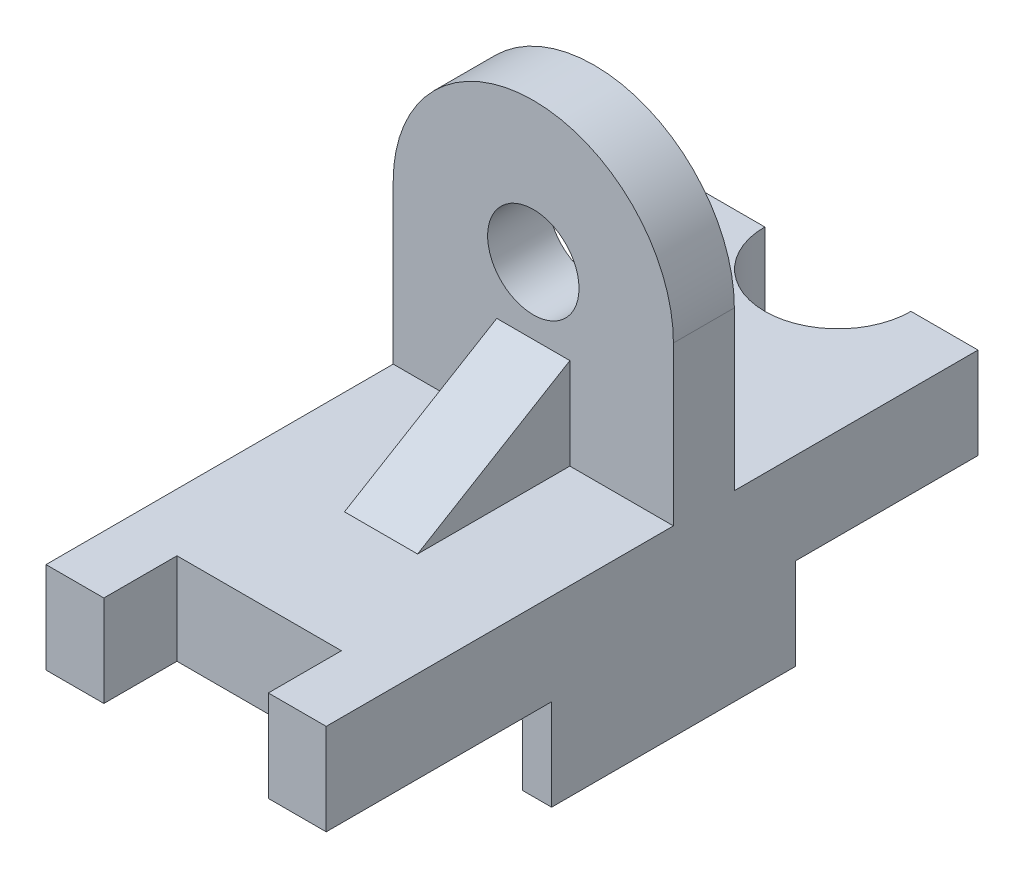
ISO-10303-21;
HEADER;
FILE_DESCRIPTION(('STEP AP214'),'2;1');
FILE_NAME('part.step','',(''),(''),'','','');
FILE_SCHEMA(('AUTOMOTIVE_DESIGN { 1 0 10303 214 1 1 1 1 }'));
ENDSEC;
DATA;
#1=APPLICATION_CONTEXT('core data for automotive mechanical design processes');
#2=APPLICATION_PROTOCOL_DEFINITION('international standard','automotive_design',2000,#1);
#3=PRODUCT_CONTEXT('',#1,'mechanical');
#4=PRODUCT('Part','Part','',(#3));
#5=PRODUCT_RELATED_PRODUCT_CATEGORY('part','',(#4));
#6=PRODUCT_DEFINITION_FORMATION('','',#4);
#7=PRODUCT_DEFINITION_CONTEXT('part definition',#1,'design');
#8=PRODUCT_DEFINITION('design','',#6,#7);
#9=PRODUCT_DEFINITION_SHAPE('','',#8);
#10=(LENGTH_UNIT() NAMED_UNIT(*) SI_UNIT(.MILLI.,.METRE.));
#11=(NAMED_UNIT(*) PLANE_ANGLE_UNIT() SI_UNIT($,.RADIAN.));
#12=(NAMED_UNIT(*) SI_UNIT($,.STERADIAN.) SOLID_ANGLE_UNIT());
#13=UNCERTAINTY_MEASURE_WITH_UNIT(LENGTH_MEASURE(1.E-05),#10,'distance_accuracy_value','');
#14=(GEOMETRIC_REPRESENTATION_CONTEXT(3) GLOBAL_UNCERTAINTY_ASSIGNED_CONTEXT((#13)) GLOBAL_UNIT_ASSIGNED_CONTEXT((#10,
#11,#12)) REPRESENTATION_CONTEXT('',''));
#15=CARTESIAN_POINT('',(0.,0.,0.));
#16=DIRECTION('',(0.,0.,1.));
#17=DIRECTION('',(1.,0.,0.));
#18=AXIS2_PLACEMENT_3D('',#15,#16,#17);
#19=CARTESIAN_POINT('',(-23.,-30.,-25.));
#20=DIRECTION('',(0.,0.,1.));
#21=DIRECTION('',(1.,0.,0.));
#22=AXIS2_PLACEMENT_3D('',#19,#20,#21);
#23=PLANE('',#22);
#24=DIRECTION('',(-1.,0.,0.));
#25=VECTOR('',#24,1.);
#26=CARTESIAN_POINT('',(0.,-20.,-25.));
#27=LINE('',#26,#25);
#28=CARTESIAN_POINT('',(18.2163610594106,-20.,-25.));
#29=VERTEX_POINT('',#28);
#30=CARTESIAN_POINT('',(-18.7836389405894,-20.,-25.));
#31=VERTEX_POINT('',#30);
#32=EDGE_CURVE('E262',#29,#31,#27,.T.);
#33=ORIENTED_EDGE('',*,*,#32,.F.);
#34=DIRECTION('',(0.,-1.,0.));
#35=VECTOR('',#34,1.);
#36=CARTESIAN_POINT('',(18.2163610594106,-20.,-25.));
#37=LINE('',#36,#35);
#38=CARTESIAN_POINT('',(18.2163610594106,-30.,-25.));
#39=VERTEX_POINT('',#38);
#40=EDGE_CURVE('E249',#29,#39,#37,.T.);
#41=ORIENTED_EDGE('',*,*,#40,.T.);
#42=DIRECTION('',(1.,0.,0.));
#43=VECTOR('',#42,1.);
#44=CARTESIAN_POINT('',(-23.,-30.,-25.));
#45=LINE('',#44,#43);
#46=CARTESIAN_POINT('',(23.,-30.,-25.));
#47=VERTEX_POINT('',#46);
#48=EDGE_CURVE('E309',#39,#47,#45,.T.);
#49=ORIENTED_EDGE('',*,*,#48,.T.);
#50=DIRECTION('',(0.,1.,0.));
#51=VECTOR('',#50,1.);
#52=CARTESIAN_POINT('',(23.,-30.,-25.));
#53=LINE('',#52,#51);
#54=CARTESIAN_POINT('',(23.,-15.,-25.));
#55=VERTEX_POINT('',#54);
#56=EDGE_CURVE('E105',#47,#55,#53,.T.);
#57=ORIENTED_EDGE('',*,*,#56,.T.);
#58=DIRECTION('',(1.,0.,0.));
#59=VECTOR('',#58,1.);
#60=CARTESIAN_POINT('',(-23.,-15.,-25.));
#61=LINE('',#60,#59);
#62=CARTESIAN_POINT('',(-23.,-15.,-25.));
#63=VERTEX_POINT('',#62);
#64=EDGE_CURVE('E305',#63,#55,#61,.T.);
#65=ORIENTED_EDGE('',*,*,#64,.F.);
#66=DIRECTION('',(0.,1.,0.));
#67=VECTOR('',#66,1.);
#68=CARTESIAN_POINT('',(-23.,-30.,-25.));
#69=LINE('',#68,#67);
#70=CARTESIAN_POINT('',(-23.,-30.,-25.));
#71=VERTEX_POINT('',#70);
#72=EDGE_CURVE('E317',#71,#63,#69,.T.);
#73=ORIENTED_EDGE('',*,*,#72,.F.);
#74=CARTESIAN_POINT('',(-18.7836389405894,-30.,-25.));
#75=VERTEX_POINT('',#74);
#76=EDGE_CURVE('E310',#71,#75,#45,.T.);
#77=ORIENTED_EDGE('',*,*,#76,.T.);
#78=DIRECTION('',(0.,-1.,0.));
#79=VECTOR('',#78,1.);
#80=CARTESIAN_POINT('',(-18.7836389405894,-20.,-25.));
#81=LINE('',#80,#79);
#82=EDGE_CURVE('E258',#31,#75,#81,.T.);
#83=ORIENTED_EDGE('',*,*,#82,.F.);
#84=EDGE_LOOP('',(#33,#41,#49,#57,#65,#73,#77,#83));
#85=FACE_BOUND('',#84,.T.);
#86=ADVANCED_FACE('F81',(#85),#23,.T.);
#87=CARTESIAN_POINT('',(0.,-30.,0.));
#88=DIRECTION('',(0.,1.,0.));
#89=DIRECTION('',(-1.,0.,0.));
#90=AXIS2_PLACEMENT_3D('',#87,#88,#89);
#91=PLANE('',#90);
#92=DIRECTION('',(0.,0.,-1.));
#93=VECTOR('',#92,1.);
#94=CARTESIAN_POINT('',(18.2163610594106,-30.,0.));
#95=LINE('',#94,#93);
#96=CARTESIAN_POINT('',(18.2163610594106,-30.,-65.));
#97=VERTEX_POINT('',#96);
#98=EDGE_CURVE('E254',#39,#97,#95,.T.);
#99=ORIENTED_EDGE('',*,*,#98,.T.);
#100=DIRECTION('',(-1.,0.,0.));
#101=VECTOR('',#100,1.);
#102=CARTESIAN_POINT('',(23.,-30.,-65.));
#103=LINE('',#102,#101);
#104=CARTESIAN_POINT('',(23.,-30.,-65.));
#105=VERTEX_POINT('',#104);
#106=EDGE_CURVE('E291',#105,#97,#103,.T.);
#107=ORIENTED_EDGE('',*,*,#106,.F.);
#108=DIRECTION('',(0.,0.,-1.));
#109=VECTOR('',#108,1.);
#110=CARTESIAN_POINT('',(23.,-30.,-25.));
#111=LINE('',#110,#109);
#112=EDGE_CURVE('E306',#47,#105,#111,.T.);
#113=ORIENTED_EDGE('',*,*,#112,.F.);
#114=ORIENTED_EDGE('',*,*,#48,.F.);
#115=EDGE_LOOP('',(#99,#107,#113,#114));
#116=FACE_BOUND('',#115,.T.);
#117=ADVANCED_FACE('F570',(#116),#91,.F.);
#118=CARTESIAN_POINT('',(23.,-30.,-65.));
#119=DIRECTION('',(0.,0.,-1.));
#120=DIRECTION('',(-1.,0.,0.));
#121=AXIS2_PLACEMENT_3D('',#118,#119,#120);
#122=PLANE('',#121);
#123=ORIENTED_EDGE('',*,*,#106,.T.);
#124=DIRECTION('',(0.,-1.,0.));
#125=VECTOR('',#124,1.);
#126=CARTESIAN_POINT('',(18.2163610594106,-20.,-65.));
#127=LINE('',#126,#125);
#128=CARTESIAN_POINT('',(18.2163610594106,-20.,-65.));
#129=VERTEX_POINT('',#128);
#130=EDGE_CURVE('E281',#129,#97,#127,.T.);
#131=ORIENTED_EDGE('',*,*,#130,.F.);
#132=DIRECTION('',(1.,0.,0.));
#133=VECTOR('',#132,1.);
#134=CARTESIAN_POINT('',(0.,-20.,-65.));
#135=LINE('',#134,#133);
#136=CARTESIAN_POINT('',(-18.7836389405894,-20.,-65.));
#137=VERTEX_POINT('',#136);
#138=EDGE_CURVE('E259',#137,#129,#135,.T.);
#139=ORIENTED_EDGE('',*,*,#138,.F.);
#140=DIRECTION('',(0.,-1.,0.));
#141=VECTOR('',#140,1.);
#142=CARTESIAN_POINT('',(-18.7836389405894,-20.,-65.));
#143=LINE('',#142,#141);
#144=CARTESIAN_POINT('',(-18.7836389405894,-30.,-65.));
#145=VERTEX_POINT('',#144);
#146=EDGE_CURVE('E285',#137,#145,#143,.T.);
#147=ORIENTED_EDGE('',*,*,#146,.T.);
#148=CARTESIAN_POINT('',(-23.,-30.,-65.));
#149=VERTEX_POINT('',#148);
#150=EDGE_CURVE('E296',#145,#149,#103,.T.);
#151=ORIENTED_EDGE('',*,*,#150,.T.);
#152=DIRECTION('',(0.,1.,0.));
#153=VECTOR('',#152,1.);
#154=CARTESIAN_POINT('',(-23.,-30.,-65.));
#155=LINE('',#154,#153);
#156=CARTESIAN_POINT('',(-23.,-15.,-65.));
#157=VERTEX_POINT('',#156);
#158=EDGE_CURVE('E302',#149,#157,#155,.T.);
#159=ORIENTED_EDGE('',*,*,#158,.T.);
#160=DIRECTION('',(-1.,0.,0.));
#161=VECTOR('',#160,1.);
#162=CARTESIAN_POINT('',(23.,-15.,-65.));
#163=LINE('',#162,#161);
#164=CARTESIAN_POINT('',(23.,-15.,-65.));
#165=VERTEX_POINT('',#164);
#166=EDGE_CURVE('E284',#165,#157,#163,.T.);
#167=ORIENTED_EDGE('',*,*,#166,.F.);
#168=DIRECTION('',(0.,1.,0.));
#169=VECTOR('',#168,1.);
#170=CARTESIAN_POINT('',(23.,-30.,-65.));
#171=LINE('',#170,#169);
#172=EDGE_CURVE('E295',#105,#165,#171,.T.);
#173=ORIENTED_EDGE('',*,*,#172,.F.);
#174=EDGE_LOOP('',(#123,#131,#139,#147,#151,#159,#167,#173));
#175=FACE_BOUND('',#174,.T.);
#176=ADVANCED_FACE('F575',(#175),#122,.T.);
#177=CARTESIAN_POINT('',(0.,-15.,0.));
#178=DIRECTION('',(0.,1.,0.));
#179=DIRECTION('',(0.,0.,1.));
#180=AXIS2_PLACEMENT_3D('',#177,#178,#179);
#181=PLANE('',#180);
#182=DIRECTION('',(0.,0.,-1.));
#183=VECTOR('',#182,1.);
#184=CARTESIAN_POINT('',(23.,-15.,0.));
#185=LINE('',#184,#183);
#186=CARTESIAN_POINT('',(23.,-15.,-95.));
#187=VERTEX_POINT('',#186);
#188=EDGE_CURVE('E353',#165,#187,#185,.T.);
#189=ORIENTED_EDGE('',*,*,#188,.F.);
#190=ORIENTED_EDGE('',*,*,#166,.T.);
#191=DIRECTION('',(0.,0.,-1.));
#192=VECTOR('',#191,1.);
#193=CARTESIAN_POINT('',(-23.,-15.,0.));
#194=LINE('',#193,#192);
#195=CARTESIAN_POINT('',(-23.,-15.,-95.));
#196=VERTEX_POINT('',#195);
#197=EDGE_CURVE('E329',#157,#196,#194,.T.);
#198=ORIENTED_EDGE('',*,*,#197,.T.);
#199=DIRECTION('',(1.,0.,0.));
#200=VECTOR('',#199,1.);
#201=CARTESIAN_POINT('',(0.,-15.,-95.));
#202=LINE('',#201,#200);
#203=CARTESIAN_POINT('',(-12.,-15.,-95.));
#204=VERTEX_POINT('',#203);
#205=EDGE_CURVE('E325',#196,#204,#202,.T.);
#206=ORIENTED_EDGE('',*,*,#205,.T.);
#207=CARTESIAN_POINT('',(0.,-15.,-95.));
#208=DIRECTION('',(0.,1.,0.));
#209=DIRECTION('',(0.,0.,1.));
#210=AXIS2_PLACEMENT_3D('',#207,#208,#209);
#211=CIRCLE('',#210,12.);
#212=CARTESIAN_POINT('',(12.,-15.,-95.));
#213=VERTEX_POINT('',#212);
#214=EDGE_CURVE('E362',#204,#213,#211,.T.);
#215=ORIENTED_EDGE('',*,*,#214,.T.);
#216=DIRECTION('',(-1.,0.,0.));
#217=VECTOR('',#216,1.);
#218=CARTESIAN_POINT('',(0.,-15.,-95.));
#219=LINE('',#218,#217);
#220=EDGE_CURVE('E358',#187,#213,#219,.T.);
#221=ORIENTED_EDGE('',*,*,#220,.F.);
#222=EDGE_LOOP('',(#189,#190,#198,#206,#215,#221));
#223=FACE_BOUND('',#222,.T.);
#224=ADVANCED_FACE('F585',(#223),#181,.F.);
#225=CARTESIAN_POINT('',(0.,49.,-55.));
#226=DIRECTION('',(0.,0.,1.));
#227=DIRECTION('',(1.,0.,0.));
#228=AXIS2_PLACEMENT_3D('',#225,#226,#227);
#229=PLANE('',#228);
#230=CARTESIAN_POINT('',(0.,26.,-55.));
#231=DIRECTION('',(0.,0.,1.));
#232=DIRECTION('',(1.,0.,0.));
#233=AXIS2_PLACEMENT_3D('',#230,#231,#232);
#234=CIRCLE('',#233,7.5);
#235=CARTESIAN_POINT('',(7.5,26.,-55.));
#236=VERTEX_POINT('',#235);
#237=EDGE_CURVE('E486',#236,#236,#234,.T.);
#238=ORIENTED_EDGE('',*,*,#237,.T.);
#239=EDGE_LOOP('',(#238));
#240=FACE_BOUND('',#239,.T.);
#241=DIRECTION('',(0.,-1.,0.));
#242=VECTOR('',#241,1.);
#243=CARTESIAN_POINT('',(-23.,49.,-55.));
#244=LINE('',#243,#242);
#245=CARTESIAN_POINT('',(-23.,26.,-55.));
#246=VERTEX_POINT('',#245);
#247=CARTESIAN_POINT('',(-23.,0.,-55.));
#248=VERTEX_POINT('',#247);
#249=EDGE_CURVE('E12',#246,#248,#244,.T.);
#250=ORIENTED_EDGE('',*,*,#249,.F.);
#251=CARTESIAN_POINT('',(0.,26.,-55.));
#252=DIRECTION('',(0.,0.,1.));
#253=DIRECTION('',(1.,0.,0.));
#254=AXIS2_PLACEMENT_3D('',#251,#252,#253);
#255=CIRCLE('',#254,23.);
#256=CARTESIAN_POINT('',(23.,26.,-55.));
#257=VERTEX_POINT('',#256);
#258=EDGE_CURVE('E483',#257,#246,#255,.T.);
#259=ORIENTED_EDGE('',*,*,#258,.F.);
#260=DIRECTION('',(0.,-1.,0.));
#261=VECTOR('',#260,1.);
#262=CARTESIAN_POINT('',(23.,49.,-55.));
#263=LINE('',#262,#261);
#264=CARTESIAN_POINT('',(23.,0.,-55.));
#265=VERTEX_POINT('',#264);
#266=EDGE_CURVE('E499',#257,#265,#263,.T.);
#267=ORIENTED_EDGE('',*,*,#266,.T.);
#268=DIRECTION('',(-1.,0.,0.));
#269=VECTOR('',#268,1.);
#270=CARTESIAN_POINT('',(0.,0.,-55.));
#271=LINE('',#270,#269);
#272=EDGE_CURVE('E490',#265,#248,#271,.T.);
#273=ORIENTED_EDGE('',*,*,#272,.T.);
#274=EDGE_LOOP('',(#250,#259,#267,#273));
#275=FACE_BOUND('',#274,.T.);
#276=ADVANCED_FACE('F83',(#240,#275),#229,.F.);
#277=CARTESIAN_POINT('',(0.,49.,-45.));
#278=DIRECTION('',(0.,0.,1.));
#279=DIRECTION('',(1.,0.,0.));
#280=AXIS2_PLACEMENT_3D('',#277,#278,#279);
#281=PLANE('',#280);
#282=DIRECTION('',(0.,-1.,0.));
#283=VECTOR('',#282,1.);
#284=CARTESIAN_POINT('',(-5.99999999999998,15.,-45.));
#285=LINE('',#284,#283);
#286=CARTESIAN_POINT('',(-5.99999999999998,15.,-45.));
#287=VERTEX_POINT('',#286);
#288=CARTESIAN_POINT('',(-5.99999999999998,0.,-45.));
#289=VERTEX_POINT('',#288);
#290=EDGE_CURVE('E465',#287,#289,#285,.T.);
#291=ORIENTED_EDGE('',*,*,#290,.F.);
#292=DIRECTION('',(-1.,0.,0.));
#293=VECTOR('',#292,1.);
#294=CARTESIAN_POINT('',(0.,15.,-45.));
#295=LINE('',#294,#293);
#296=CARTESIAN_POINT('',(6.,15.,-45.));
#297=VERTEX_POINT('',#296);
#298=EDGE_CURVE('E447',#297,#287,#295,.T.);
#299=ORIENTED_EDGE('',*,*,#298,.F.);
#300=DIRECTION('',(0.,-1.,0.));
#301=VECTOR('',#300,1.);
#302=CARTESIAN_POINT('',(6.,15.,-45.));
#303=LINE('',#302,#301);
#304=CARTESIAN_POINT('',(6.,0.,-45.));
#305=VERTEX_POINT('',#304);
#306=EDGE_CURVE('E451',#297,#305,#303,.T.);
#307=ORIENTED_EDGE('',*,*,#306,.T.);
#308=DIRECTION('',(-1.,0.,0.));
#309=VECTOR('',#308,1.);
#310=CARTESIAN_POINT('',(0.,0.,-45.));
#311=LINE('',#310,#309);
#312=CARTESIAN_POINT('',(23.,0.,-45.));
#313=VERTEX_POINT('',#312);
#314=EDGE_CURVE('E495',#313,#305,#311,.T.);
#315=ORIENTED_EDGE('',*,*,#314,.F.);
#316=DIRECTION('',(0.,-1.,0.));
#317=VECTOR('',#316,1.);
#318=CARTESIAN_POINT('',(23.,49.,-45.));
#319=LINE('',#318,#317);
#320=CARTESIAN_POINT('',(23.,26.,-45.));
#321=VERTEX_POINT('',#320);
#322=EDGE_CURVE('E502',#321,#313,#319,.T.);
#323=ORIENTED_EDGE('',*,*,#322,.F.);
#324=CARTESIAN_POINT('',(0.,26.,-45.));
#325=DIRECTION('',(0.,0.,1.));
#326=DIRECTION('',(1.,0.,0.));
#327=AXIS2_PLACEMENT_3D('',#324,#325,#326);
#328=CIRCLE('',#327,23.);
#329=CARTESIAN_POINT('',(-23.,26.,-45.));
#330=VERTEX_POINT('',#329);
#331=EDGE_CURVE('E472',#321,#330,#328,.T.);
#332=ORIENTED_EDGE('',*,*,#331,.T.);
#333=DIRECTION('',(0.,-1.,0.));
#334=VECTOR('',#333,1.);
#335=CARTESIAN_POINT('',(-23.,49.,-45.));
#336=LINE('',#335,#334);
#337=CARTESIAN_POINT('',(-23.,0.,-45.));
#338=VERTEX_POINT('',#337);
#339=EDGE_CURVE('E90',#330,#338,#336,.T.);
#340=ORIENTED_EDGE('',*,*,#339,.T.);
#341=EDGE_CURVE('E494',#289,#338,#311,.T.);
#342=ORIENTED_EDGE('',*,*,#341,.F.);
#343=EDGE_LOOP('',(#291,#299,#307,#315,#323,#332,#340,#342));
#344=FACE_BOUND('',#343,.T.);
#345=CARTESIAN_POINT('',(0.,26.,-45.));
#346=DIRECTION('',(0.,0.,1.));
#347=DIRECTION('',(1.,0.,0.));
#348=AXIS2_PLACEMENT_3D('',#345,#346,#347);
#349=CIRCLE('',#348,7.5);
#350=CARTESIAN_POINT('',(7.5,26.,-45.));
#351=VERTEX_POINT('',#350);
#352=EDGE_CURVE('E479',#351,#351,#349,.T.);
#353=ORIENTED_EDGE('',*,*,#352,.F.);
#354=EDGE_LOOP('',(#353));
#355=FACE_BOUND('',#354,.T.);
#356=ADVANCED_FACE('F509',(#344,#355),#281,.T.);
#357=CARTESIAN_POINT('',(-23.,49.,0.));
#358=DIRECTION('',(-1.,0.,0.));
#359=DIRECTION('',(0.,0.,1.));
#360=AXIS2_PLACEMENT_3D('',#357,#358,#359);
#361=PLANE('',#360);
#362=DIRECTION('',(0.,0.,1.));
#363=VECTOR('',#362,1.);
#364=CARTESIAN_POINT('',(-23.,26.,-94.));
#365=LINE('',#364,#363);
#366=EDGE_CURVE('E468',#246,#330,#365,.T.);
#367=ORIENTED_EDGE('',*,*,#366,.F.);
#368=ORIENTED_EDGE('',*,*,#249,.T.);
#369=DIRECTION('',(0.,0.,-1.));
#370=VECTOR('',#369,1.);
#371=CARTESIAN_POINT('',(-23.,0.,0.));
#372=LINE('',#371,#370);
#373=CARTESIAN_POINT('',(-23.,0.,-95.));
#374=VERTEX_POINT('',#373);
#375=EDGE_CURVE('E369',#248,#374,#372,.T.);
#376=ORIENTED_EDGE('',*,*,#375,.T.);
#377=DIRECTION('',(0.,1.,0.));
#378=VECTOR('',#377,1.);
#379=CARTESIAN_POINT('',(-23.,-15.,-95.));
#380=LINE('',#379,#378);
#381=EDGE_CURVE('E365',#196,#374,#380,.T.);
#382=ORIENTED_EDGE('',*,*,#381,.F.);
#383=ORIENTED_EDGE('',*,*,#197,.F.);
#384=ORIENTED_EDGE('',*,*,#158,.F.);
#385=DIRECTION('',(0.,0.,1.));
#386=VECTOR('',#385,1.);
#387=CARTESIAN_POINT('',(-23.,-30.,-45.));
#388=LINE('',#387,#386);
#389=EDGE_CURVE('E313',#149,#71,#388,.T.);
#390=ORIENTED_EDGE('',*,*,#389,.T.);
#391=ORIENTED_EDGE('',*,*,#72,.T.);
#392=CARTESIAN_POINT('',(-23.,-15.,12.));
#393=VERTEX_POINT('',#392);
#394=EDGE_CURVE('E331',#393,#63,#194,.T.);
#395=ORIENTED_EDGE('',*,*,#394,.F.);
#396=DIRECTION('',(0.,1.,0.));
#397=VECTOR('',#396,1.);
#398=CARTESIAN_POINT('',(-23.,-15.,12.));
#399=LINE('',#398,#397);
#400=CARTESIAN_POINT('',(-23.,0.,12.));
#401=VERTEX_POINT('',#400);
#402=EDGE_CURVE('E432',#393,#401,#399,.T.);
#403=ORIENTED_EDGE('',*,*,#402,.T.);
#404=EDGE_CURVE('E370',#401,#338,#372,.T.);
#405=ORIENTED_EDGE('',*,*,#404,.T.);
#406=ORIENTED_EDGE('',*,*,#339,.F.);
#407=EDGE_LOOP('',(#367,#368,#376,#382,#383,#384,#390,#391,#395,#403,#405,#406));
#408=FACE_BOUND('',#407,.T.);
#409=ADVANCED_FACE('F519',(#408),#361,.T.);
#410=CARTESIAN_POINT('',(23.,49.,0.));
#411=DIRECTION('',(-1.,0.,0.));
#412=DIRECTION('',(0.,0.,1.));
#413=AXIS2_PLACEMENT_3D('',#410,#411,#412);
#414=PLANE('',#413);
#415=ORIENTED_EDGE('',*,*,#266,.F.);
#416=DIRECTION('',(0.,0.,1.));
#417=VECTOR('',#416,1.);
#418=CARTESIAN_POINT('',(23.,26.,-94.));
#419=LINE('',#418,#417);
#420=EDGE_CURVE('E475',#257,#321,#419,.T.);
#421=ORIENTED_EDGE('',*,*,#420,.T.);
#422=ORIENTED_EDGE('',*,*,#322,.T.);
#423=DIRECTION('',(0.,0.,-1.));
#424=VECTOR('',#423,1.);
#425=CARTESIAN_POINT('',(23.,0.,0.));
#426=LINE('',#425,#424);
#427=CARTESIAN_POINT('',(23.,0.,12.));
#428=VERTEX_POINT('',#427);
#429=EDGE_CURVE('E393',#428,#313,#426,.T.);
#430=ORIENTED_EDGE('',*,*,#429,.F.);
#431=DIRECTION('',(0.,1.,0.));
#432=VECTOR('',#431,1.);
#433=CARTESIAN_POINT('',(23.,-15.,12.));
#434=LINE('',#433,#432);
#435=CARTESIAN_POINT('',(23.,-15.,12.));
#436=VERTEX_POINT('',#435);
#437=EDGE_CURVE('E416',#436,#428,#434,.T.);
#438=ORIENTED_EDGE('',*,*,#437,.F.);
#439=EDGE_CURVE('E354',#436,#55,#185,.T.);
#440=ORIENTED_EDGE('',*,*,#439,.T.);
#441=ORIENTED_EDGE('',*,*,#56,.F.);
#442=ORIENTED_EDGE('',*,*,#112,.T.);
#443=ORIENTED_EDGE('',*,*,#172,.T.);
#444=ORIENTED_EDGE('',*,*,#188,.T.);
#445=DIRECTION('',(0.,1.,0.));
#446=VECTOR('',#445,1.);
#447=CARTESIAN_POINT('',(23.,-15.,-95.));
#448=LINE('',#447,#446);
#449=CARTESIAN_POINT('',(23.,0.,-95.));
#450=VERTEX_POINT('',#449);
#451=EDGE_CURVE('E412',#187,#450,#448,.T.);
#452=ORIENTED_EDGE('',*,*,#451,.T.);
#453=EDGE_CURVE('E392',#265,#450,#426,.T.);
#454=ORIENTED_EDGE('',*,*,#453,.F.);
#455=EDGE_LOOP('',(#415,#421,#422,#430,#438,#440,#441,#442,#443,#444,#452,#454));
#456=FACE_BOUND('',#455,.T.);
#457=ADVANCED_FACE('F545',(#456),#414,.F.);
#458=CARTESIAN_POINT('',(0.,26.,-94.));
#459=DIRECTION('',(0.,0.,1.));
#460=DIRECTION('',(1.,0.,0.));
#461=AXIS2_PLACEMENT_3D('',#458,#459,#460);
#462=CYLINDRICAL_SURFACE('',#461,23.);
#463=ORIENTED_EDGE('',*,*,#258,.T.);
#464=ORIENTED_EDGE('',*,*,#366,.T.);
#465=ORIENTED_EDGE('',*,*,#331,.F.);
#466=ORIENTED_EDGE('',*,*,#420,.F.);
#467=EDGE_LOOP('',(#463,#464,#465,#466));
#468=FACE_BOUND('',#467,.T.);
#469=ADVANCED_FACE('F565',(#468),#462,.T.);
#470=CARTESIAN_POINT('',(0.,26.,-94.));
#471=DIRECTION('',(0.,0.,1.));
#472=DIRECTION('',(1.,0.,0.));
#473=AXIS2_PLACEMENT_3D('',#470,#471,#472);
#474=CYLINDRICAL_SURFACE('',#473,7.5);
#475=ORIENTED_EDGE('',*,*,#352,.T.);
#476=EDGE_LOOP('',(#475));
#477=FACE_BOUND('',#476,.T.);
#478=ORIENTED_EDGE('',*,*,#237,.F.);
#479=EDGE_LOOP('',(#478));
#480=FACE_BOUND('',#479,.T.);
#481=ADVANCED_FACE('F558',(#477,#480),#474,.F.);
#482=CARTESIAN_POINT('',(-5.99999999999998,15.,0.));
#483=DIRECTION('',(-1.,0.,0.));
#484=DIRECTION('',(0.,0.,1.));
#485=AXIS2_PLACEMENT_3D('',#482,#483,#484);
#486=PLANE('',#485);
#487=DIRECTION('',(0.,-0.514495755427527,0.857492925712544));
#488=VECTOR('',#487,1.);
#489=CARTESIAN_POINT('',(-5.99999999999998,-4.85294117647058,-11.9117647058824));
#490=LINE('',#489,#488);
#491=CARTESIAN_POINT('',(-5.99999999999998,0.,-20.));
#492=VERTEX_POINT('',#491);
#493=EDGE_CURVE('E442',#287,#492,#490,.T.);
#494=ORIENTED_EDGE('',*,*,#493,.F.);
#495=ORIENTED_EDGE('',*,*,#290,.T.);
#496=DIRECTION('',(0.,0.,-1.));
#497=VECTOR('',#496,1.);
#498=CARTESIAN_POINT('',(-5.99999999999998,0.,0.));
#499=LINE('',#498,#497);
#500=EDGE_CURVE('E446',#492,#289,#499,.T.);
#501=ORIENTED_EDGE('',*,*,#500,.F.);
#502=EDGE_LOOP('',(#494,#495,#501));
#503=FACE_BOUND('',#502,.T.);
#504=ADVANCED_FACE('F556',(#503),#486,.T.);
#505=CARTESIAN_POINT('',(6.00000000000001,15.,0.));
#506=DIRECTION('',(-1.,0.,0.));
#507=DIRECTION('',(0.,0.,1.));
#508=AXIS2_PLACEMENT_3D('',#505,#506,#507);
#509=PLANE('',#508);
#510=ORIENTED_EDGE('',*,*,#306,.F.);
#511=DIRECTION('',(0.,0.514495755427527,-0.857492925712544));
#512=VECTOR('',#511,1.);
#513=CARTESIAN_POINT('',(5.99999999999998,15.,-45.));
#514=LINE('',#513,#512);
#515=CARTESIAN_POINT('',(6.,0.,-20.));
#516=VERTEX_POINT('',#515);
#517=EDGE_CURVE('E408',#516,#297,#514,.T.);
#518=ORIENTED_EDGE('',*,*,#517,.F.);
#519=DIRECTION('',(0.,0.,-1.));
#520=VECTOR('',#519,1.);
#521=CARTESIAN_POINT('',(6.00000000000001,0.,0.));
#522=LINE('',#521,#520);
#523=EDGE_CURVE('E452',#516,#305,#522,.T.);
#524=ORIENTED_EDGE('',*,*,#523,.T.);
#525=EDGE_LOOP('',(#510,#518,#524));
#526=FACE_BOUND('',#525,.T.);
#527=ADVANCED_FACE('F551',(#526),#509,.F.);
#528=CARTESIAN_POINT('',(136.969982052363,15.,-45.));
#529=DIRECTION('',(0.,-0.857492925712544,-0.514495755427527));
#530=DIRECTION('',(0.,0.514495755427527,-0.857492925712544));
#531=AXIS2_PLACEMENT_3D('',#528,#529,#530);
#532=PLANE('',#531);
#533=ORIENTED_EDGE('',*,*,#298,.T.);
#534=ORIENTED_EDGE('',*,*,#493,.T.);
#535=DIRECTION('',(-1.,0.,0.));
#536=VECTOR('',#535,1.);
#537=CARTESIAN_POINT('',(0.,0.,-20.));
#538=LINE('',#537,#536);
#539=EDGE_CURVE('E456',#516,#492,#538,.T.);
#540=ORIENTED_EDGE('',*,*,#539,.F.);
#541=ORIENTED_EDGE('',*,*,#517,.T.);
#542=EDGE_LOOP('',(#533,#534,#540,#541));
#543=FACE_BOUND('',#542,.T.);
#544=ADVANCED_FACE('F553',(#543),#532,.F.);
#545=CARTESIAN_POINT('',(0.,0.,0.));
#546=DIRECTION('',(0.,1.,0.));
#547=DIRECTION('',(0.,0.,1.));
#548=AXIS2_PLACEMENT_3D('',#545,#546,#547);
#549=PLANE('',#548);
#550=ORIENTED_EDGE('',*,*,#272,.F.);
#551=ORIENTED_EDGE('',*,*,#453,.T.);
#552=DIRECTION('',(-1.,0.,0.));
#553=VECTOR('',#552,1.);
#554=CARTESIAN_POINT('',(0.,0.,-95.));
#555=LINE('',#554,#553);
#556=CARTESIAN_POINT('',(12.,0.,-95.));
#557=VERTEX_POINT('',#556);
#558=EDGE_CURVE('E397',#450,#557,#555,.T.);
#559=ORIENTED_EDGE('',*,*,#558,.T.);
#560=CARTESIAN_POINT('',(0.,0.,-95.));
#561=DIRECTION('',(0.,1.,0.));
#562=DIRECTION('',(0.,0.,1.));
#563=AXIS2_PLACEMENT_3D('',#560,#561,#562);
#564=CIRCLE('',#563,12.);
#565=CARTESIAN_POINT('',(-12.,0.,-95.));
#566=VERTEX_POINT('',#565);
#567=EDGE_CURVE('E330',#566,#557,#564,.T.);
#568=ORIENTED_EDGE('',*,*,#567,.F.);
#569=DIRECTION('',(1.,0.,0.));
#570=VECTOR('',#569,1.);
#571=CARTESIAN_POINT('',(0.,0.,-95.));
#572=LINE('',#571,#570);
#573=EDGE_CURVE('E324',#374,#566,#572,.T.);
#574=ORIENTED_EDGE('',*,*,#573,.F.);
#575=ORIENTED_EDGE('',*,*,#375,.F.);
#576=EDGE_LOOP('',(#550,#551,#559,#568,#574,#575));
#577=FACE_BOUND('',#576,.T.);
#578=ADVANCED_FACE('F588',(#577),#549,.T.);
#579=CARTESIAN_POINT('',(0.,-15.,-95.));
#580=DIRECTION('',(0.,0.,1.));
#581=DIRECTION('',(1.,0.,0.));
#582=AXIS2_PLACEMENT_3D('',#579,#580,#581);
#583=PLANE('',#582);
#584=ORIENTED_EDGE('',*,*,#573,.T.);
#585=DIRECTION('',(0.,1.,0.));
#586=VECTOR('',#585,1.);
#587=CARTESIAN_POINT('',(-12.,-15.,-95.));
#588=LINE('',#587,#586);
#589=EDGE_CURVE('E404',#204,#566,#588,.T.);
#590=ORIENTED_EDGE('',*,*,#589,.F.);
#591=ORIENTED_EDGE('',*,*,#205,.F.);
#592=ORIENTED_EDGE('',*,*,#381,.T.);
#593=EDGE_LOOP('',(#584,#590,#591,#592));
#594=FACE_BOUND('',#593,.T.);
#595=ADVANCED_FACE('F593',(#594),#583,.F.);
#596=CARTESIAN_POINT('',(0.,-15.,-95.));
#597=DIRECTION('',(0.,1.,0.));
#598=DIRECTION('',(0.,0.,1.));
#599=AXIS2_PLACEMENT_3D('',#596,#597,#598);
#600=CYLINDRICAL_SURFACE('',#599,12.);
#601=ORIENTED_EDGE('',*,*,#567,.T.);
#602=DIRECTION('',(0.,1.,0.));
#603=VECTOR('',#602,1.);
#604=CARTESIAN_POINT('',(12.,-15.,-95.));
#605=LINE('',#604,#603);
#606=EDGE_CURVE('E409',#213,#557,#605,.T.);
#607=ORIENTED_EDGE('',*,*,#606,.F.);
#608=ORIENTED_EDGE('',*,*,#214,.F.);
#609=ORIENTED_EDGE('',*,*,#589,.T.);
#610=EDGE_LOOP('',(#601,#607,#608,#609));
#611=FACE_BOUND('',#610,.T.);
#612=ADVANCED_FACE('F589',(#611),#600,.F.);
#613=CARTESIAN_POINT('',(0.,-15.,-95.));
#614=DIRECTION('',(0.,0.,-1.));
#615=DIRECTION('',(-1.,0.,0.));
#616=AXIS2_PLACEMENT_3D('',#613,#614,#615);
#617=PLANE('',#616);
#618=ORIENTED_EDGE('',*,*,#558,.F.);
#619=ORIENTED_EDGE('',*,*,#451,.F.);
#620=ORIENTED_EDGE('',*,*,#220,.T.);
#621=ORIENTED_EDGE('',*,*,#606,.T.);
#622=EDGE_LOOP('',(#618,#619,#620,#621));
#623=FACE_BOUND('',#622,.T.);
#624=ADVANCED_FACE('F592',(#623),#617,.T.);
#625=CARTESIAN_POINT('',(0.,-15.,12.));
#626=DIRECTION('',(0.,0.,1.));
#627=DIRECTION('',(1.,0.,0.));
#628=AXIS2_PLACEMENT_3D('',#625,#626,#627);
#629=PLANE('',#628);
#630=DIRECTION('',(1.,0.,0.));
#631=VECTOR('',#630,1.);
#632=CARTESIAN_POINT('',(0.,0.,12.));
#633=LINE('',#632,#631);
#634=CARTESIAN_POINT('',(13.5,0.,12.));
#635=VERTEX_POINT('',#634);
#636=EDGE_CURVE('E388',#635,#428,#633,.T.);
#637=ORIENTED_EDGE('',*,*,#636,.F.);
#638=DIRECTION('',(0.,1.,0.));
#639=VECTOR('',#638,1.);
#640=CARTESIAN_POINT('',(13.5,-15.,12.));
#641=LINE('',#640,#639);
#642=CARTESIAN_POINT('',(13.5,-15.,12.));
#643=VERTEX_POINT('',#642);
#644=EDGE_CURVE('E419',#643,#635,#641,.T.);
#645=ORIENTED_EDGE('',*,*,#644,.F.);
#646=DIRECTION('',(1.,0.,0.));
#647=VECTOR('',#646,1.);
#648=CARTESIAN_POINT('',(0.,-15.,12.));
#649=LINE('',#648,#647);
#650=EDGE_CURVE('E349',#643,#436,#649,.T.);
#651=ORIENTED_EDGE('',*,*,#650,.T.);
#652=ORIENTED_EDGE('',*,*,#437,.T.);
#653=EDGE_LOOP('',(#637,#645,#651,#652));
#654=FACE_BOUND('',#653,.T.);
#655=ADVANCED_FACE('F540',(#654),#629,.T.);
#656=CARTESIAN_POINT('',(13.5,-15.,0.));
#657=DIRECTION('',(-1.,0.,0.));
#658=DIRECTION('',(0.,0.,1.));
#659=AXIS2_PLACEMENT_3D('',#656,#657,#658);
#660=PLANE('',#659);
#661=DIRECTION('',(0.,0.,1.));
#662=VECTOR('',#661,1.);
#663=CARTESIAN_POINT('',(13.5,0.,0.));
#664=LINE('',#663,#662);
#665=CARTESIAN_POINT('',(13.5,0.,0.));
#666=VERTEX_POINT('',#665);
#667=EDGE_CURVE('E384',#666,#635,#664,.T.);
#668=ORIENTED_EDGE('',*,*,#667,.F.);
#669=DIRECTION('',(0.,1.,0.));
#670=VECTOR('',#669,1.);
#671=CARTESIAN_POINT('',(13.5,-15.,0.));
#672=LINE('',#671,#670);
#673=CARTESIAN_POINT('',(13.5,-15.,0.));
#674=VERTEX_POINT('',#673);
#675=EDGE_CURVE('E422',#674,#666,#672,.T.);
#676=ORIENTED_EDGE('',*,*,#675,.F.);
#677=DIRECTION('',(0.,0.,1.));
#678=VECTOR('',#677,1.);
#679=CARTESIAN_POINT('',(13.5,-15.,0.));
#680=LINE('',#679,#678);
#681=EDGE_CURVE('E345',#674,#643,#680,.T.);
#682=ORIENTED_EDGE('',*,*,#681,.T.);
#683=ORIENTED_EDGE('',*,*,#644,.T.);
#684=EDGE_LOOP('',(#668,#676,#682,#683));
#685=FACE_BOUND('',#684,.T.);
#686=ADVANCED_FACE('F536',(#685),#660,.T.);
#687=CARTESIAN_POINT('',(0.,-15.,0.));
#688=DIRECTION('',(0.,0.,1.));
#689=DIRECTION('',(1.,0.,0.));
#690=AXIS2_PLACEMENT_3D('',#687,#688,#689);
#691=PLANE('',#690);
#692=DIRECTION('',(1.,0.,0.));
#693=VECTOR('',#692,1.);
#694=CARTESIAN_POINT('',(0.,0.,0.));
#695=LINE('',#694,#693);
#696=CARTESIAN_POINT('',(-13.5,0.,0.));
#697=VERTEX_POINT('',#696);
#698=EDGE_CURVE('E380',#697,#666,#695,.T.);
#699=ORIENTED_EDGE('',*,*,#698,.F.);
#700=DIRECTION('',(0.,1.,0.));
#701=VECTOR('',#700,1.);
#702=CARTESIAN_POINT('',(-13.5,-15.,0.));
#703=LINE('',#702,#701);
#704=CARTESIAN_POINT('',(-13.5,-15.,0.));
#705=VERTEX_POINT('',#704);
#706=EDGE_CURVE('E425',#705,#697,#703,.T.);
#707=ORIENTED_EDGE('',*,*,#706,.F.);
#708=DIRECTION('',(1.,0.,0.));
#709=VECTOR('',#708,1.);
#710=CARTESIAN_POINT('',(0.,-15.,0.));
#711=LINE('',#710,#709);
#712=EDGE_CURVE('E341',#705,#674,#711,.T.);
#713=ORIENTED_EDGE('',*,*,#712,.T.);
#714=ORIENTED_EDGE('',*,*,#675,.T.);
#715=EDGE_LOOP('',(#699,#707,#713,#714));
#716=FACE_BOUND('',#715,.T.);
#717=ADVANCED_FACE('F530',(#716),#691,.T.);
#718=CARTESIAN_POINT('',(-13.5,-15.,0.));
#719=DIRECTION('',(-1.,0.,0.));
#720=DIRECTION('',(0.,0.,1.));
#721=AXIS2_PLACEMENT_3D('',#718,#719,#720);
#722=PLANE('',#721);
#723=DIRECTION('',(0.,0.,1.));
#724=VECTOR('',#723,1.);
#725=CARTESIAN_POINT('',(-13.5,0.,0.));
#726=LINE('',#725,#724);
#727=CARTESIAN_POINT('',(-13.5,0.,12.));
#728=VERTEX_POINT('',#727);
#729=EDGE_CURVE('E377',#697,#728,#726,.T.);
#730=ORIENTED_EDGE('',*,*,#729,.T.);
#731=DIRECTION('',(0.,1.,0.));
#732=VECTOR('',#731,1.);
#733=CARTESIAN_POINT('',(-13.5,-15.,12.));
#734=LINE('',#733,#732);
#735=CARTESIAN_POINT('',(-13.5,-15.,12.));
#736=VERTEX_POINT('',#735);
#737=EDGE_CURVE('E428',#736,#728,#734,.T.);
#738=ORIENTED_EDGE('',*,*,#737,.F.);
#739=DIRECTION('',(0.,0.,1.));
#740=VECTOR('',#739,1.);
#741=CARTESIAN_POINT('',(-13.5,-15.,0.));
#742=LINE('',#741,#740);
#743=EDGE_CURVE('E338',#705,#736,#742,.T.);
#744=ORIENTED_EDGE('',*,*,#743,.F.);
#745=ORIENTED_EDGE('',*,*,#706,.T.);
#746=EDGE_LOOP('',(#730,#738,#744,#745));
#747=FACE_BOUND('',#746,.T.);
#748=ADVANCED_FACE('F604',(#747),#722,.F.);
#749=CARTESIAN_POINT('',(0.,-15.,12.));
#750=DIRECTION('',(0.,0.,-1.));
#751=DIRECTION('',(-1.,0.,0.));
#752=AXIS2_PLACEMENT_3D('',#749,#750,#751);
#753=PLANE('',#752);
#754=DIRECTION('',(-1.,0.,0.));
#755=VECTOR('',#754,1.);
#756=CARTESIAN_POINT('',(0.,0.,12.));
#757=LINE('',#756,#755);
#758=EDGE_CURVE('E374',#728,#401,#757,.T.);
#759=ORIENTED_EDGE('',*,*,#758,.T.);
#760=ORIENTED_EDGE('',*,*,#402,.F.);
#761=DIRECTION('',(-1.,0.,0.));
#762=VECTOR('',#761,1.);
#763=CARTESIAN_POINT('',(0.,-15.,12.));
#764=LINE('',#763,#762);
#765=EDGE_CURVE('E335',#736,#393,#764,.T.);
#766=ORIENTED_EDGE('',*,*,#765,.F.);
#767=ORIENTED_EDGE('',*,*,#737,.T.);
#768=EDGE_LOOP('',(#759,#760,#766,#767));
#769=FACE_BOUND('',#768,.T.);
#770=ADVANCED_FACE('F524',(#769),#753,.F.);
#771=ORIENTED_EDGE('',*,*,#394,.T.);
#772=ORIENTED_EDGE('',*,*,#64,.T.);
#773=ORIENTED_EDGE('',*,*,#439,.F.);
#774=ORIENTED_EDGE('',*,*,#650,.F.);
#775=ORIENTED_EDGE('',*,*,#681,.F.);
#776=ORIENTED_EDGE('',*,*,#712,.F.);
#777=ORIENTED_EDGE('',*,*,#743,.T.);
#778=ORIENTED_EDGE('',*,*,#765,.T.);
#779=EDGE_LOOP('',(#771,#772,#773,#774,#775,#776,#777,#778));
#780=FACE_BOUND('',#779,.T.);
#781=ADVANCED_FACE('F581',(#780),#181,.F.);
#782=ORIENTED_EDGE('',*,*,#429,.T.);
#783=ORIENTED_EDGE('',*,*,#314,.T.);
#784=ORIENTED_EDGE('',*,*,#523,.F.);
#785=ORIENTED_EDGE('',*,*,#539,.T.);
#786=ORIENTED_EDGE('',*,*,#500,.T.);
#787=ORIENTED_EDGE('',*,*,#341,.T.);
#788=ORIENTED_EDGE('',*,*,#404,.F.);
#789=ORIENTED_EDGE('',*,*,#758,.F.);
#790=ORIENTED_EDGE('',*,*,#729,.F.);
#791=ORIENTED_EDGE('',*,*,#698,.T.);
#792=ORIENTED_EDGE('',*,*,#667,.T.);
#793=ORIENTED_EDGE('',*,*,#636,.T.);
#794=EDGE_LOOP('',(#782,#783,#784,#785,#786,#787,#788,#789,#790,#791,#792,#793));
#795=FACE_BOUND('',#794,.T.);
#796=ADVANCED_FACE('F516',(#795),#549,.T.);
#797=ORIENTED_EDGE('',*,*,#150,.F.);
#798=DIRECTION('',(0.,0.,-1.));
#799=VECTOR('',#798,1.);
#800=CARTESIAN_POINT('',(-18.7836389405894,-30.,0.));
#801=LINE('',#800,#799);
#802=EDGE_CURVE('E267',#75,#145,#801,.T.);
#803=ORIENTED_EDGE('',*,*,#802,.F.);
#804=ORIENTED_EDGE('',*,*,#76,.F.);
#805=ORIENTED_EDGE('',*,*,#389,.F.);
#806=EDGE_LOOP('',(#797,#803,#804,#805));
#807=FACE_BOUND('',#806,.T.);
#808=ADVANCED_FACE('F578',(#807),#91,.F.);
#809=CARTESIAN_POINT('',(18.2163610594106,-20.,0.));
#810=DIRECTION('',(-1.,0.,0.));
#811=DIRECTION('',(0.,0.,1.));
#812=AXIS2_PLACEMENT_3D('',#809,#810,#811);
#813=PLANE('',#812);
#814=ORIENTED_EDGE('',*,*,#98,.F.);
#815=ORIENTED_EDGE('',*,*,#40,.F.);
#816=DIRECTION('',(0.,0.,-1.));
#817=VECTOR('',#816,1.);
#818=CARTESIAN_POINT('',(18.2163610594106,-20.,0.));
#819=LINE('',#818,#817);
#820=EDGE_CURVE('E252',#29,#129,#819,.T.);
#821=ORIENTED_EDGE('',*,*,#820,.T.);
#822=ORIENTED_EDGE('',*,*,#130,.T.);
#823=EDGE_LOOP('',(#814,#815,#821,#822));
#824=FACE_BOUND('',#823,.T.);
#825=ADVANCED_FACE('F251',(#824),#813,.T.);
#826=CARTESIAN_POINT('',(-18.7836389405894,-20.,0.));
#827=DIRECTION('',(-1.,0.,0.));
#828=DIRECTION('',(0.,0.,1.));
#829=AXIS2_PLACEMENT_3D('',#826,#827,#828);
#830=PLANE('',#829);
#831=ORIENTED_EDGE('',*,*,#802,.T.);
#832=ORIENTED_EDGE('',*,*,#146,.F.);
#833=DIRECTION('',(0.,0.,-1.));
#834=VECTOR('',#833,1.);
#835=CARTESIAN_POINT('',(-18.7836389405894,-20.,0.));
#836=LINE('',#835,#834);
#837=EDGE_CURVE('E97',#31,#137,#836,.T.);
#838=ORIENTED_EDGE('',*,*,#837,.F.);
#839=ORIENTED_EDGE('',*,*,#82,.T.);
#840=EDGE_LOOP('',(#831,#832,#838,#839));
#841=FACE_BOUND('',#840,.T.);
#842=ADVANCED_FACE('F661',(#841),#830,.F.);
#843=CARTESIAN_POINT('',(0.,-20.,0.));
#844=DIRECTION('',(0.,-1.,0.));
#845=DIRECTION('',(0.,0.,-1.));
#846=AXIS2_PLACEMENT_3D('',#843,#844,#845);
#847=PLANE('',#846);
#848=ORIENTED_EDGE('',*,*,#820,.F.);
#849=ORIENTED_EDGE('',*,*,#32,.T.);
#850=ORIENTED_EDGE('',*,*,#837,.T.);
#851=ORIENTED_EDGE('',*,*,#138,.T.);
#852=EDGE_LOOP('',(#848,#849,#850,#851));
#853=FACE_BOUND('',#852,.T.);
#854=ADVANCED_FACE('F261',(#853),#847,.T.);
#855=CLOSED_SHELL('',(#86,#117,#176,#224,#276,#356,#409,#457,#469,#481,#504,#527,#544,#578,#595,
#612,#624,#655,#686,#717,#748,#770,#781,#796,#808,#825,#842,#854));
#856=MANIFOLD_SOLID_BREP('B2',#855);
#857=ADVANCED_BREP_SHAPE_REPRESENTATION('',(#18,#856),#14);
#858=SHAPE_DEFINITION_REPRESENTATION(#9,#857);
ENDSEC;
END-ISO-10303-21;
